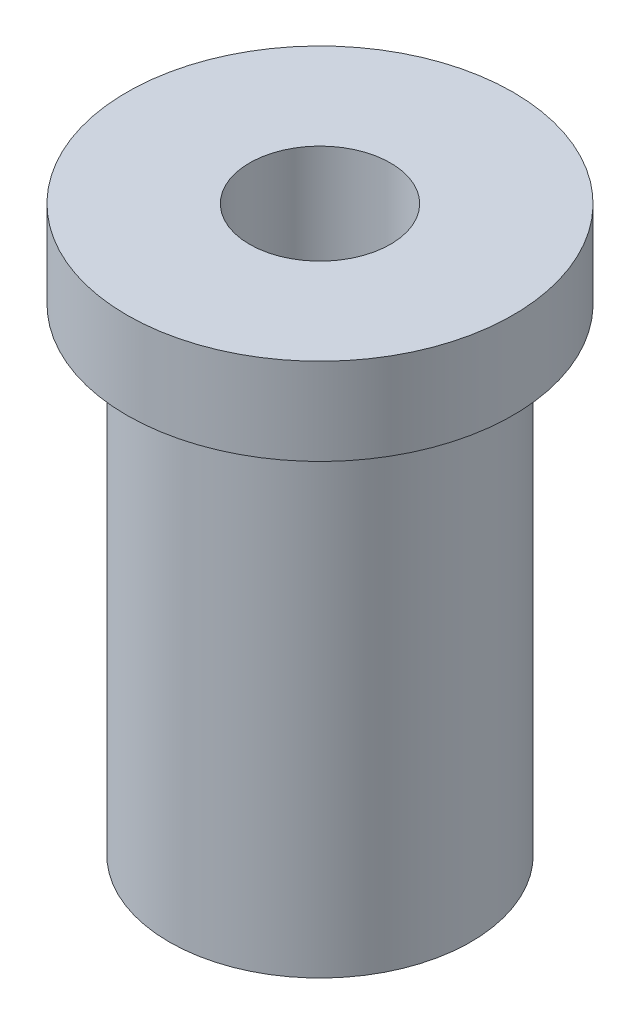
from build123d import *

# Parameters (mm, degrees)
SKICA1_R                 = 6.95
P_IDAT_VYSUNUT_M1_DEPTH  = 22
SKICA2_R                 = 8.9
P_IDAT_VYSUNUT_M2_DEPTH  = 4
ZAOBLIT1_R               = 0.3
SKICA3_R                 = 3.25
ODEBRAT_VYSUNUT_M1_DEPTH = 29.886328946


with BuildPart() as part:
    # Skica1 → P_idat vysunut_m1 (new body)
    with BuildSketch(Plane(origin=(0, 0, 0), x_dir=(1, 0, 0), z_dir=(0, 1, 0))):
        with Locations(Location((0, 0, 0), (0, 0, 270))):
            Circle(SKICA1_R)
    extrude(amount=P_IDAT_VYSUNUT_M1_DEPTH)

    # Skica2 → P_idat vysunut_m2 (add)
    with BuildSketch(Plane(origin=(0, 22, 0), x_dir=(-1, 0, 0), z_dir=(0, 1, 0))):
        with Locations(Location((0, 0, 0), (0, 0, 90))):
            Circle(SKICA2_R)
    extrude(amount=P_IDAT_VYSUNUT_M2_DEPTH)

    # Zaoblit1
    zaoblit1_edges = [part.edges().sort_by_distance(p)[0] for p in [
        (0, 22, -6.95),
    ]]
    fillet(zaoblit1_edges, radius=ZAOBLIT1_R)

    # Skica3 → Odebrat vysunut_m1 (cut, through all)
    with BuildSketch(Plane(origin=(0, 26, 0), x_dir=(1, 0, 0), z_dir=(0, 1, 0))):
        with Locations(Location((0, 0, 0), (0, 0, 270))):
            Circle(SKICA3_R)
    extrude(amount=-ODEBRAT_VYSUNUT_M1_DEPTH, mode=Mode.SUBTRACT)


solid = part.part
